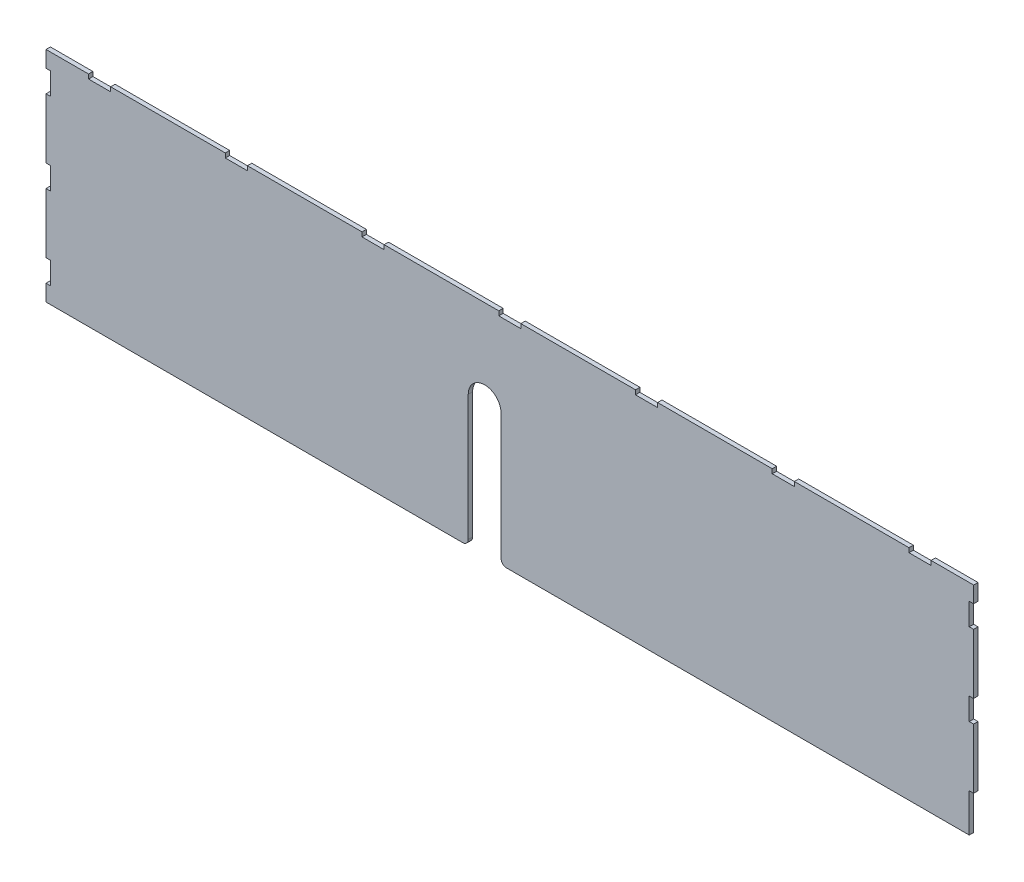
from build123d import *

# Parameters (mm, degrees)
SKIZZE1_W                       = 848
SKIZZE1_H                       = 200
AUFSATZ_LINEAR_AUSTRAGEN1_DEPTH = 4
SKIZZE2_W                       = 4
SKIZZE2_H                       = 20.2
SKIZZE2_H_2                     = 35.1
SKIZZE2_W_2                     = 20.2
SKIZZE2_H_3                     = 4
SCHNITT_LINEAR_AUSTRAGEN1_DEPTH = 436.651236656
SCHNITT_LINEAR_AUSTRAGEN2_DEPTH = 436.651236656
VERRUNDUNG1_R                   = 5


with BuildPart() as part:
    # Skizze1 → Aufsatz-Linear austragen1 (new body)
    with BuildSketch(Plane.XY):
        Rectangle(SKIZZE1_W, SKIZZE1_H)
    extrude(amount=AUFSATZ_LINEAR_AUSTRAGEN1_DEPTH)

    # Skizze2 → Schnitt-Linear austragen1 (cut, through all)
    with BuildSketch(Plane.XY.offset(4)):
        with Locations((-422, -75)):
            Rectangle(SKIZZE2_W, SKIZZE2_H)
        with Locations((-422, 0)):
            Rectangle(SKIZZE2_W, SKIZZE2_H)
        with Locations((-422, 75)):
            Rectangle(SKIZZE2_W, SKIZZE2_H)
        with Locations((422, 75)):
            Rectangle(SKIZZE2_W, SKIZZE2_H)
        with Locations((422, 0)):
            Rectangle(SKIZZE2_W, SKIZZE2_H)
        with Locations((422, -82.45)):
            Rectangle(SKIZZE2_W, SKIZZE2_H_2)
        with Locations((-375, 98)):
            Rectangle(SKIZZE2_W_2, SKIZZE2_H_3)
        with Locations((-250, 98)):
            Rectangle(SKIZZE2_W_2, SKIZZE2_H_3)
        with Locations((-125, 98)):
            Rectangle(SKIZZE2_W_2, SKIZZE2_H_3)
        with Locations((0, 98)):
            Rectangle(SKIZZE2_W_2, SKIZZE2_H_3)
        with Locations((125, 98)):
            Rectangle(SKIZZE2_W_2, SKIZZE2_H_3)
        with Locations((250, 98)):
            Rectangle(SKIZZE2_W_2, SKIZZE2_H_3)
        with Locations((375, 98)):
            Rectangle(SKIZZE2_W_2, SKIZZE2_H_3)
    extrude(amount=-SCHNITT_LINEAR_AUSTRAGEN1_DEPTH, mode=Mode.SUBTRACT)

    # Skizze3 → Schnitt-Linear austragen2 (cut, through all)
    with BuildSketch(Plane.XY.offset(4)):
        with BuildLine():
            Line((-38, -100), (-38, 20))
            ThreePointArc((-38, 20), (-23, 35), (-8, 20))
            Line((-8, 20), (-8, -100))
            Line((-8, -100), (-38, -100))
        make_face()
    extrude(amount=-SCHNITT_LINEAR_AUSTRAGEN2_DEPTH, mode=Mode.SUBTRACT)

    # Verrundung1
    verrundung1_edges = [part.edges().sort_by_distance(p)[0] for p in [
        (-8, -100, 2),
        (-38, -100, 2),
    ]]
    fillet(verrundung1_edges, radius=VERRUNDUNG1_R)


solid = part.part
